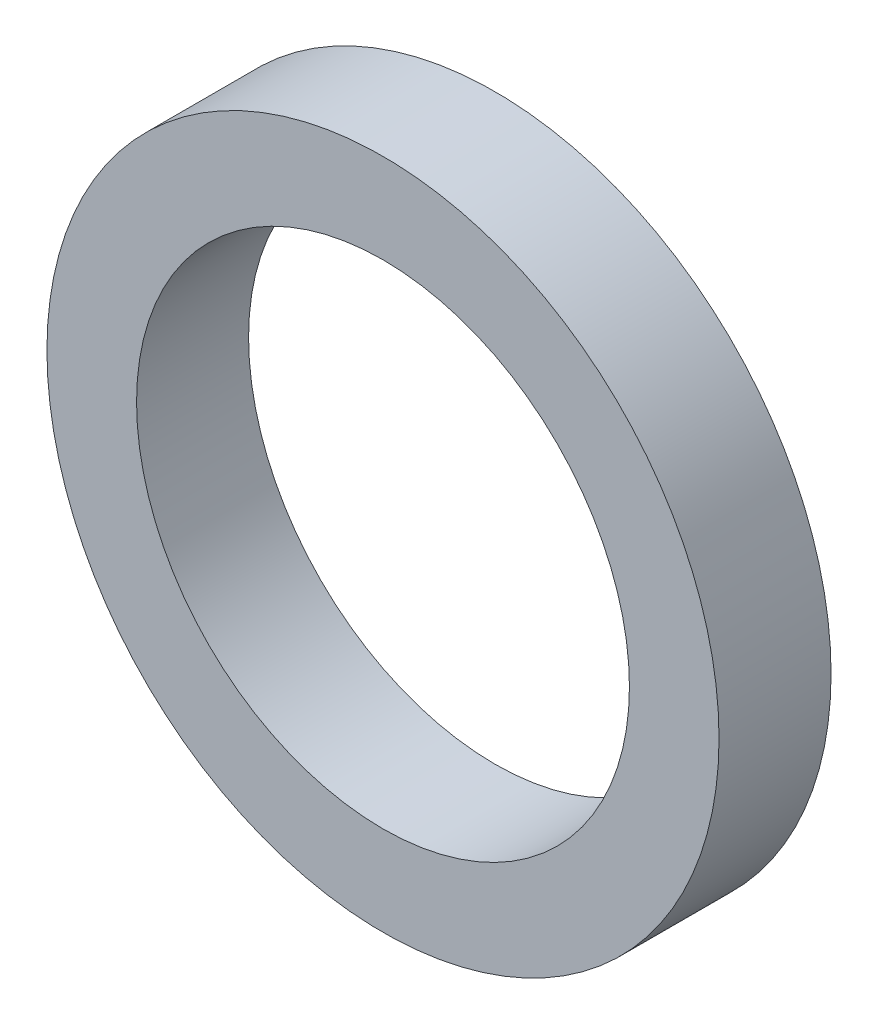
from build123d import *

# Parameters (mm, degrees)
ESQUISSE1_R             = 75
BOSS_EXTRU_1_DEPTH      = 25
ESQUISSE2_R             = 55
ENL_V_MAT_EXTRU_1_DEPTH = 66


with BuildPart() as part:
    # Esquisse1 → Boss.-Extru.1 (new body)
    with BuildSketch(Plane.XY):
        Circle(ESQUISSE1_R)
    extrude(amount=BOSS_EXTRU_1_DEPTH)

    # Esquisse2 → Enl_v. mat.-Extru.1 (cut)
    with BuildSketch(Plane.XY.offset(25)):
        Circle(ESQUISSE2_R)
    extrude(amount=-ENL_V_MAT_EXTRU_1_DEPTH, mode=Mode.SUBTRACT)


solid = part.part
